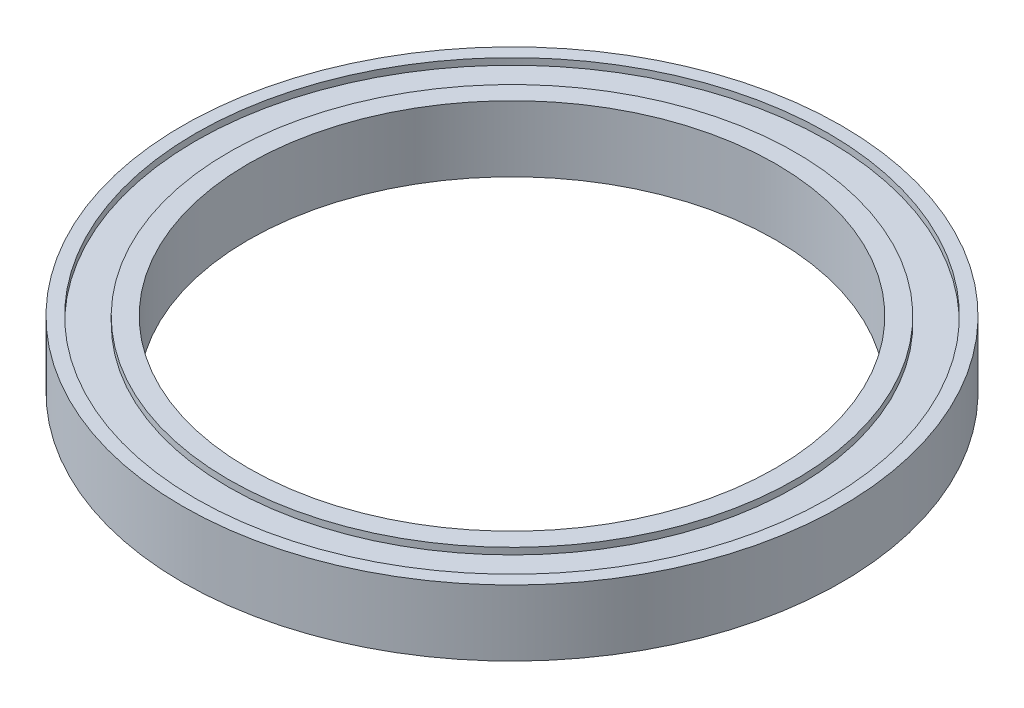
from build123d import *

# Parameters (mm, degrees)
SKETCH1_R           = 50
SKETCH1_R_2         = 40
BOSS_EXTRUDE1_DEPTH = 10
SKETCH2_R           = 48
SKETCH2_R_2         = 43
CUT_EXTRUDE1_DEPTH  = 1
CUT_EXTRUDE2_START  = -1
SKETCH3_R           = 48
SKETCH3_R_2         = 43
CUT_EXTRUDE2_DEPTH  = 1


with BuildPart() as part:
    # Sketch1 → Boss-Extrude1 (new body)
    with BuildSketch(Plane(origin=(0, 0, 0), x_dir=(1, 0, 0), z_dir=(0, 1, 0))):
        with Locations(Location((0, 0, 0), (0, 0, 270))):
            Circle(SKETCH1_R)
        with Locations(Location((0, 0, 0), (0, 0, 270))):
            Circle(SKETCH1_R_2, mode=Mode.SUBTRACT)
    extrude(amount=BOSS_EXTRUDE1_DEPTH)

    # Sketch2 → Cut-Extrude1 (cut)
    with BuildSketch(Plane(origin=(0, 10, 0), x_dir=(1, 0, 0), z_dir=(0, 1, 0))):
        with Locations(Location((0, 0, 0), (0, 0, 270))):
            Circle(SKETCH2_R)
        with Locations(Location((0, 0, 0), (0, 0, 270))):
            Circle(SKETCH2_R_2, mode=Mode.SUBTRACT)
    extrude(amount=-CUT_EXTRUDE1_DEPTH, mode=Mode.SUBTRACT)

    # Sketch3 → Cut-Extrude2 (cut)
    with BuildSketch(Plane.XZ.offset(CUT_EXTRUDE2_START)):
        with Locations(Location((0, 0, 0), (0, 0, 90))):
            Circle(SKETCH3_R)
        with Locations(Location((0, 0, 0), (0, 0, 90))):
            Circle(SKETCH3_R_2, mode=Mode.SUBTRACT)
    extrude(amount=CUT_EXTRUDE2_DEPTH, mode=Mode.SUBTRACT)


solid = part.part
